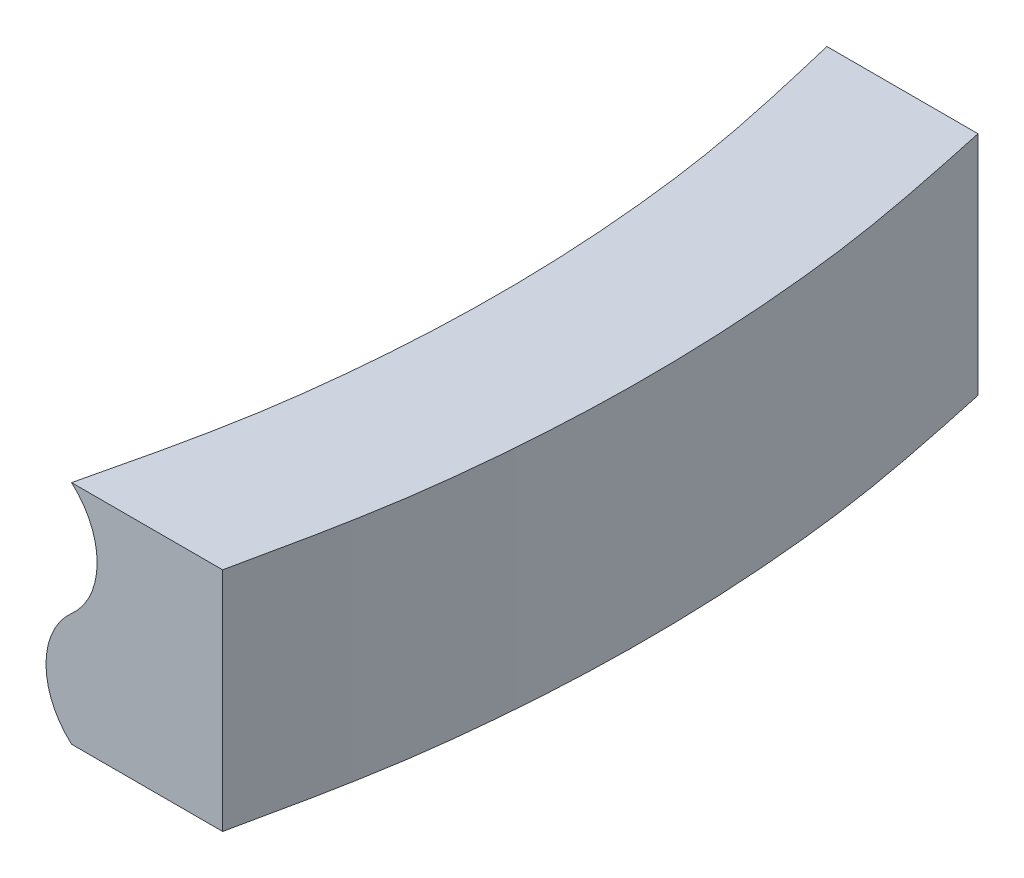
ISO-10303-21;
HEADER;
FILE_DESCRIPTION(('STEP AP214'),'2;1');
FILE_NAME('part.step','',(''),(''),'','','');
FILE_SCHEMA(('AUTOMOTIVE_DESIGN { 1 0 10303 214 1 1 1 1 }'));
ENDSEC;
DATA;
#1=APPLICATION_CONTEXT('core data for automotive mechanical design processes');
#2=APPLICATION_PROTOCOL_DEFINITION('international standard','automotive_design',2000,#1);
#3=PRODUCT_CONTEXT('',#1,'mechanical');
#4=PRODUCT('Part','Part','',(#3));
#5=PRODUCT_RELATED_PRODUCT_CATEGORY('part','',(#4));
#6=PRODUCT_DEFINITION_FORMATION('','',#4);
#7=PRODUCT_DEFINITION_CONTEXT('part definition',#1,'design');
#8=PRODUCT_DEFINITION('design','',#6,#7);
#9=PRODUCT_DEFINITION_SHAPE('','',#8);
#10=(LENGTH_UNIT() NAMED_UNIT(*) SI_UNIT(.MILLI.,.METRE.));
#11=(NAMED_UNIT(*) PLANE_ANGLE_UNIT() SI_UNIT($,.RADIAN.));
#12=(NAMED_UNIT(*) SI_UNIT($,.STERADIAN.) SOLID_ANGLE_UNIT());
#13=UNCERTAINTY_MEASURE_WITH_UNIT(LENGTH_MEASURE(1.E-05),#10,'distance_accuracy_value','');
#14=(GEOMETRIC_REPRESENTATION_CONTEXT(3) GLOBAL_UNCERTAINTY_ASSIGNED_CONTEXT((#13)) GLOBAL_UNIT_ASSIGNED_CONTEXT((#10,
#11,#12)) REPRESENTATION_CONTEXT('',''));
#15=CARTESIAN_POINT('',(0.,0.,0.));
#16=DIRECTION('',(0.,0.,1.));
#17=DIRECTION('',(1.,0.,0.));
#18=AXIS2_PLACEMENT_3D('',#15,#16,#17);
#19=CARTESIAN_POINT('',(-33.2287565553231,15.,0.));
#20=DIRECTION('',(0.,0.,1.));
#21=DIRECTION('',(1.,0.,0.));
#22=AXIS2_PLACEMENT_3D('',#19,#20,#21);
#23=PLANE('',#22);
#24=CARTESIAN_POINT('',(-33.2287565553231,15.,0.));
#25=DIRECTION('',(0.,0.,-1.));
#26=DIRECTION('',(1.,0.,0.));
#27=AXIS2_PLACEMENT_3D('',#24,#25,#26);
#28=CIRCLE('',#27,20.0000000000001);
#29=CARTESIAN_POINT('',(-20.,30.,0.));
#30=VERTEX_POINT('',#29);
#31=CARTESIAN_POINT('',(-20.0000000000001,0.,0.));
#32=VERTEX_POINT('',#31);
#33=EDGE_CURVE('E594',#30,#32,#28,.T.);
#34=ORIENTED_EDGE('',*,*,#33,.F.);
#35=DIRECTION('',(-1.,0.,0.));
#36=VECTOR('',#35,1.);
#37=CARTESIAN_POINT('',(20.,30.,0.));
#38=LINE('',#37,#36);
#39=CARTESIAN_POINT('',(20.,30.,0.));
#40=VERTEX_POINT('',#39);
#41=EDGE_CURVE('E596',#40,#30,#38,.T.);
#42=ORIENTED_EDGE('',*,*,#41,.F.);
#43=DIRECTION('',(0.,1.,0.));
#44=VECTOR('',#43,1.);
#45=CARTESIAN_POINT('',(20.,-30.,0.));
#46=LINE('',#45,#44);
#47=CARTESIAN_POINT('',(20.,-30.,0.));
#48=VERTEX_POINT('',#47);
#49=EDGE_CURVE('E592',#48,#40,#46,.T.);
#50=ORIENTED_EDGE('',*,*,#49,.F.);
#51=DIRECTION('',(1.,0.,0.));
#52=VECTOR('',#51,1.);
#53=CARTESIAN_POINT('',(20.,-30.,0.));
#54=LINE('',#53,#52);
#55=CARTESIAN_POINT('',(-20.,-30.,0.));
#56=VERTEX_POINT('',#55);
#57=EDGE_CURVE('E519',#56,#48,#54,.T.);
#58=ORIENTED_EDGE('',*,*,#57,.F.);
#59=CARTESIAN_POINT('',(-6.77124344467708,-15.,0.));
#60=DIRECTION('',(0.,0.,1.));
#61=DIRECTION('',(-1.,0.,0.));
#62=AXIS2_PLACEMENT_3D('',#59,#60,#61);
#63=CIRCLE('',#62,20.);
#64=EDGE_CURVE('E12',#32,#56,#63,.T.);
#65=ORIENTED_EDGE('',*,*,#64,.F.);
#66=EDGE_LOOP('',(#34,#42,#50,#58,#65));
#67=FACE_BOUND('',#66,.T.);
#68=ADVANCED_FACE('F509',(#67),#23,.F.);
#69=CARTESIAN_POINT('',(-33.228756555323,15.,200.));
#70=DIRECTION('',(0.,0.,1.));
#71=DIRECTION('',(1.,0.,0.));
#72=AXIS2_PLACEMENT_3D('',#69,#70,#71);
#73=PLANE('',#72);
#74=CARTESIAN_POINT('',(-33.228756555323,15.,200.));
#75=DIRECTION('',(0.,0.,-1.));
#76=DIRECTION('',(1.,0.,0.));
#77=AXIS2_PLACEMENT_3D('',#74,#75,#76);
#78=CIRCLE('',#77,20.);
#79=CARTESIAN_POINT('',(-20.,30.,200.));
#80=VERTEX_POINT('',#79);
#81=CARTESIAN_POINT('',(-20.,0.,200.));
#82=VERTEX_POINT('',#81);
#83=EDGE_CURVE('E586',#80,#82,#78,.T.);
#84=ORIENTED_EDGE('',*,*,#83,.T.);
#85=CARTESIAN_POINT('',(-6.77124344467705,-15.,200.));
#86=DIRECTION('',(0.,0.,1.));
#87=DIRECTION('',(-1.,0.,0.));
#88=AXIS2_PLACEMENT_3D('',#85,#86,#87);
#89=CIRCLE('',#88,20.);
#90=CARTESIAN_POINT('',(-20.,-30.,200.));
#91=VERTEX_POINT('',#90);
#92=EDGE_CURVE('E761',#82,#91,#89,.T.);
#93=ORIENTED_EDGE('',*,*,#92,.T.);
#94=DIRECTION('',(1.,0.,0.));
#95=VECTOR('',#94,1.);
#96=CARTESIAN_POINT('',(20.,-30.,200.));
#97=LINE('',#96,#95);
#98=CARTESIAN_POINT('',(20.,-30.,200.));
#99=VERTEX_POINT('',#98);
#100=EDGE_CURVE('E567',#91,#99,#97,.T.);
#101=ORIENTED_EDGE('',*,*,#100,.T.);
#102=DIRECTION('',(0.,1.,0.));
#103=VECTOR('',#102,1.);
#104=CARTESIAN_POINT('',(20.,-30.,200.));
#105=LINE('',#104,#103);
#106=CARTESIAN_POINT('',(20.,30.,200.));
#107=VERTEX_POINT('',#106);
#108=EDGE_CURVE('E559',#99,#107,#105,.T.);
#109=ORIENTED_EDGE('',*,*,#108,.T.);
#110=DIRECTION('',(-1.,0.,0.));
#111=VECTOR('',#110,1.);
#112=CARTESIAN_POINT('',(20.,30.,200.));
#113=LINE('',#112,#111);
#114=EDGE_CURVE('E564',#107,#80,#113,.T.);
#115=ORIENTED_EDGE('',*,*,#114,.T.);
#116=EDGE_LOOP('',(#84,#93,#101,#109,#115));
#117=FACE_BOUND('',#116,.T.);
#118=ADVANCED_FACE('F563',(#117),#73,.T.);
#119=CARTESIAN_POINT('',(20.,-30.,200.));
#120=DIRECTION('',(0.,-1.,0.));
#121=DIRECTION('',(-1.,0.,0.));
#122=AXIS2_PLACEMENT_3D('',#119,#120,#121);
#123=PLANE('',#122);
#124=ORIENTED_EDGE('',*,*,#100,.F.);
#125=CARTESIAN_POINT('',(-20.,-30.,200.));
#126=CARTESIAN_POINT('',(-16.5585497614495,-30.,185.554718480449));
#127=CARTESIAN_POINT('',(-12.1780591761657,-30.,167.167871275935));
#128=CARTESIAN_POINT('',(-8.32611579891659,-30.,137.735032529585));
#129=CARTESIAN_POINT('',(-6.59535172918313,-30.,114.842220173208));
#130=CARTESIAN_POINT('',(-6.59534850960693,-30.,85.1578720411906));
#131=CARTESIAN_POINT('',(-8.32605050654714,-30.,62.2651656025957));
#132=CARTESIAN_POINT('',(-12.1779761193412,-30.,32.8323454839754));
#133=CARTESIAN_POINT('',(-16.5585067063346,-30.,14.4454042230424));
#134=CARTESIAN_POINT('',(-20.,-30.,0.));
#135=B_SPLINE_CURVE_WITH_KNOTS('',3,(#125,#126,#127,#128,#129,#130,#131,#132,#133,#134),
.UNSPECIFIED.,.F.,.F.,(4,1,1,1,1,1,1,4),(0.,0.219963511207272,0.279983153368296,
0.43999217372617,0.560007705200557,0.720015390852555,0.780034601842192,1.),.UNSPECIFIED.);
#136=EDGE_CURVE('E534',#91,#56,#135,.T.);
#137=ORIENTED_EDGE('',*,*,#136,.T.);
#138=ORIENTED_EDGE('',*,*,#57,.T.);
#139=CARTESIAN_POINT('',(20.,-30.,200.));
#140=CARTESIAN_POINT('',(23.1151661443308,-30.,185.511956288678));
#141=CARTESIAN_POINT('',(27.0803421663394,-30.,167.070678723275));
#142=CARTESIAN_POINT('',(30.5631498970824,-30.,137.666206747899));
#143=CARTESIAN_POINT('',(32.1279583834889,-30.,114.817469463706));
#144=CARTESIAN_POINT('',(32.1279610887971,-30.,85.1826650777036));
#145=CARTESIAN_POINT('',(30.5632148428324,-30.,62.3340576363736));
#146=CARTESIAN_POINT('',(27.0804291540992,-30.,32.9295296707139));
#147=CARTESIAN_POINT('',(23.1152103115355,-30.,14.488162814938));
#148=CARTESIAN_POINT('',(20.,-30.,0.));
#149=B_SPLINE_CURVE_WITH_KNOTS('',3,(#139,#140,#141,#142,#143,#144,#145,#146,#147,#148),
.UNSPECIFIED.,.F.,.F.,(4,1,1,1,1,1,1,4),(0.,0.219963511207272,0.279983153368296,
0.43999217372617,0.560007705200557,0.720015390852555,0.780034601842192,1.),.UNSPECIFIED.);
#150=EDGE_CURVE('E613',#48,#99,#149,.F.);
#151=ORIENTED_EDGE('',*,*,#150,.T.);
#152=EDGE_LOOP('',(#124,#137,#138,#151));
#153=FACE_BOUND('',#152,.T.);
#154=ADVANCED_FACE('F653',(#153),#123,.T.);
#155=CARTESIAN_POINT('',(-20.,-30.,200.));
#156=CARTESIAN_POINT('',(-16.5585497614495,-30.,185.554718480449));
#157=CARTESIAN_POINT('',(-12.1780591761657,-30.,167.167871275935));
#158=CARTESIAN_POINT('',(-8.32611579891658,-30.,137.735032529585));
#159=CARTESIAN_POINT('',(-6.59535172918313,-30.,114.842220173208));
#160=CARTESIAN_POINT('',(-6.59534850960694,-30.,85.1578720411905));
#161=CARTESIAN_POINT('',(-8.32605050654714,-30.,62.2651656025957));
#162=CARTESIAN_POINT('',(-12.1779761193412,-30.,32.8323454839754));
#163=CARTESIAN_POINT('',(-16.5585067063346,-30.,14.4454042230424));
#164=CARTESIAN_POINT('',(-20.,-30.,0.));
#165=CARTESIAN_POINT('',(-21.0600775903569,-29.0650994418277,200.));
#166=CARTESIAN_POINT('',(-17.6130201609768,-29.0623754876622,185.555859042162));
#167=CARTESIAN_POINT('',(-13.2253923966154,-29.0589082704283,167.170463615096));
#168=CARTESIAN_POINT('',(-9.36703102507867,-29.0557820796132,137.736875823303));
#169=CARTESIAN_POINT('',(-7.63337194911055,-29.0543707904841,114.842883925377));
#170=CARTESIAN_POINT('',(-7.6333687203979,-29.0543707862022,85.1572071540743));
#171=CARTESIAN_POINT('',(-9.36696572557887,-29.0557820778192,62.2633205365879));
#172=CARTESIAN_POINT('',(-13.2253094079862,-29.0589083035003,32.8297533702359));
#173=CARTESIAN_POINT('',(-17.6129771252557,-29.0623754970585,14.444263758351));
#174=CARTESIAN_POINT('',(-21.0600775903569,-29.0650994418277,0.));
#175=CARTESIAN_POINT('',(-22.9813051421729,-26.9698133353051,200.));
#176=CARTESIAN_POINT('',(-19.5211231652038,-26.9618430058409,185.557919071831));
#177=CARTESIAN_POINT('',(-15.1167896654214,-26.9516978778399,167.175145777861));
#178=CARTESIAN_POINT('',(-11.2441810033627,-26.9430182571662,137.740199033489));
#179=CARTESIAN_POINT('',(-9.5040168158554,-26.9390611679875,114.844079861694));
#180=CARTESIAN_POINT('',(-9.50401356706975,-26.9390611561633,85.156009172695));
#181=CARTESIAN_POINT('',(-11.2441156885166,-26.9430182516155,62.2599941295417));
#182=CARTESIAN_POINT('',(-15.1167068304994,-26.9516979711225,32.8250716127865));
#183=CARTESIAN_POINT('',(-19.5210801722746,-26.9618430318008,14.4422039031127));
#184=CARTESIAN_POINT('',(-22.9813051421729,-26.9698133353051,0.));
#185=CARTESIAN_POINT('',(-25.1371152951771,-23.2906453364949,199.999999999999));
#186=CARTESIAN_POINT('',(-21.6590406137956,-23.28048493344,185.560222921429));
#187=CARTESIAN_POINT('',(-17.2319321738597,-23.2675521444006,167.180382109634));
#188=CARTESIAN_POINT('',(-13.3371211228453,-23.2555317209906,137.743902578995));
#189=CARTESIAN_POINT('',(-11.5871860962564,-23.2501997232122,114.845411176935));
#190=CARTESIAN_POINT('',(-11.5871828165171,-23.2501997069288,85.1546755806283));
#191=CARTESIAN_POINT('',(-13.3370557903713,-23.2555317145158,62.2562870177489));
#192=CARTESIAN_POINT('',(-17.2318495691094,-23.2675522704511,32.8198357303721));
#193=CARTESIAN_POINT('',(-21.658997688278,-23.2804849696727,14.4399002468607));
#194=CARTESIAN_POINT('',(-25.1371152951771,-23.2906453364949,0.));
#195=CARTESIAN_POINT('',(-26.470511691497,-19.2402865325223,200.000000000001));
#196=CARTESIAN_POINT('',(-22.9762727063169,-19.2329440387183,185.561635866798));
#197=CARTESIAN_POINT('',(-18.5285893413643,-19.223598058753,167.183593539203));
#198=CARTESIAN_POINT('',(-14.6184866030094,-19.2158622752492,137.74616901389));
#199=CARTESIAN_POINT('',(-12.8613925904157,-19.2123403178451,114.846225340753));
#200=CARTESIAN_POINT('',(-12.8613892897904,-19.2123403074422,85.153860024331));
#201=CARTESIAN_POINT('',(-14.6184212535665,-19.2158622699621,62.254018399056));
#202=CARTESIAN_POINT('',(-18.5285069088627,-19.2235981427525,32.8166245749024));
#203=CARTESIAN_POINT('',(-22.9762298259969,-19.2329440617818,14.4384874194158));
#204=CARTESIAN_POINT('',(-26.470511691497,-19.2402865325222,0.));
#205=CARTESIAN_POINT('',(-26.9216918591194,-15.,199.999999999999));
#206=CARTESIAN_POINT('',(-23.4244269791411,-15.,185.562119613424));
#207=CARTESIAN_POINT('',(-18.9728920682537,-15.0000000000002,167.184693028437));
#208=CARTESIAN_POINT('',(-15.0560436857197,-14.9999999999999,137.746942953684));
#209=CARTESIAN_POINT('',(-13.2962964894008,-15.,114.846503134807));
#210=CARTESIAN_POINT('',(-13.2962931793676,-15.0000000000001,85.1535817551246));
#211=CARTESIAN_POINT('',(-15.0559783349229,-14.9999999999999,62.2532437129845));
#212=CARTESIAN_POINT('',(-18.9728096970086,-15.0000000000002,32.8155251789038));
#213=CARTESIAN_POINT('',(-23.4243841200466,-15.0000000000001,14.4380037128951));
#214=CARTESIAN_POINT('',(-26.9216918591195,-15.,0.));
#215=CARTESIAN_POINT('',(-26.470511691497,-10.7597134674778,200.000000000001));
#216=CARTESIAN_POINT('',(-22.976272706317,-10.7670559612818,185.561635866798));
#217=CARTESIAN_POINT('',(-18.5285893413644,-10.776401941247,167.183593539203));
#218=CARTESIAN_POINT('',(-14.6184866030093,-10.7841377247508,137.746169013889));
#219=CARTESIAN_POINT('',(-12.8613925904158,-10.7876596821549,114.846225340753));
#220=CARTESIAN_POINT('',(-12.8613892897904,-10.7876596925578,85.153860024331));
#221=CARTESIAN_POINT('',(-14.6184212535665,-10.784137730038,62.254018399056));
#222=CARTESIAN_POINT('',(-18.5285069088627,-10.7764018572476,32.8166245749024));
#223=CARTESIAN_POINT('',(-22.976229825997,-10.7670559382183,14.4384874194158));
#224=CARTESIAN_POINT('',(-26.4705116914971,-10.7597134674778,0.));
#225=CARTESIAN_POINT('',(-25.1371152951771,-6.70935466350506,200.));
#226=CARTESIAN_POINT('',(-21.6590406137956,-6.71951506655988,185.56022292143));
#227=CARTESIAN_POINT('',(-17.2319321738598,-6.73244785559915,167.180382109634));
#228=CARTESIAN_POINT('',(-13.3371211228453,-6.74446827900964,137.743902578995));
#229=CARTESIAN_POINT('',(-11.5871860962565,-6.74980027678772,114.845411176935));
#230=CARTESIAN_POINT('',(-11.5871828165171,-6.74980029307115,85.1546755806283));
#231=CARTESIAN_POINT('',(-13.3370557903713,-6.74446828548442,62.2562870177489));
#232=CARTESIAN_POINT('',(-17.2318495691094,-6.73244772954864,32.819835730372));
#233=CARTESIAN_POINT('',(-21.658997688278,-6.71951503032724,14.4399002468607));
#234=CARTESIAN_POINT('',(-25.1371152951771,-6.7093546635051,0.));
#235=CARTESIAN_POINT('',(-22.9813051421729,-3.03018666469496,200.));
#236=CARTESIAN_POINT('',(-19.5211231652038,-3.03815699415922,185.557919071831));
#237=CARTESIAN_POINT('',(-15.1167896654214,-3.04830212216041,167.175145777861));
#238=CARTESIAN_POINT('',(-11.2441810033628,-3.05698174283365,137.740199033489));
#239=CARTESIAN_POINT('',(-9.50401681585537,-3.06093883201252,114.844079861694));
#240=CARTESIAN_POINT('',(-9.50401356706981,-3.06093884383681,85.1560091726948));
#241=CARTESIAN_POINT('',(-11.2441156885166,-3.0569817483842,62.2599941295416));
#242=CARTESIAN_POINT('',(-15.1167068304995,-3.04830202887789,32.8250716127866));
#243=CARTESIAN_POINT('',(-19.5210801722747,-3.03815696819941,14.4422039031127));
#244=CARTESIAN_POINT('',(-22.981305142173,-3.03018666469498,0.));
#245=CARTESIAN_POINT('',(-21.0600775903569,-0.934900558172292,200.));
#246=CARTESIAN_POINT('',(-17.6130201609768,-0.937624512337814,185.555859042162));
#247=CARTESIAN_POINT('',(-13.2253923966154,-0.941091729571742,167.170463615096));
#248=CARTESIAN_POINT('',(-9.36703102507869,-0.944217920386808,137.736875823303));
#249=CARTESIAN_POINT('',(-7.6333719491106,-0.945629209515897,114.842883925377));
#250=CARTESIAN_POINT('',(-7.63336872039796,-0.945629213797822,85.1572071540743));
#251=CARTESIAN_POINT('',(-9.36696572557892,-0.944217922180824,62.2633205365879));
#252=CARTESIAN_POINT('',(-13.2253094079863,-0.94109169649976,32.8297533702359));
#253=CARTESIAN_POINT('',(-17.6129771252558,-0.937624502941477,14.444263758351));
#254=CARTESIAN_POINT('',(-21.060077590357,-0.934900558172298,0.));
#255=CARTESIAN_POINT('',(-18.9399224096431,0.93490055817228,200.));
#256=CARTESIAN_POINT('',(-15.5040793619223,0.937624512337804,185.553577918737));
#257=CARTESIAN_POINT('',(-11.130725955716,0.941091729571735,167.165278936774));
#258=CARTESIAN_POINT('',(-7.28520057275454,0.944217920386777,137.733189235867));
#259=CARTESIAN_POINT('',(-5.55733150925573,0.945629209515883,114.841556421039));
#260=CARTESIAN_POINT('',(-5.55732829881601,0.945629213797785,85.1585369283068));
#261=CARTESIAN_POINT('',(-7.28513528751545,0.944217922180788,62.2670106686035));
#262=CARTESIAN_POINT('',(-11.1306428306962,0.941091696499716,32.8349375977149));
#263=CARTESIAN_POINT('',(-15.5040362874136,0.937624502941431,14.4465446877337));
#264=CARTESIAN_POINT('',(-18.9399224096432,0.93490055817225,0.));
#265=CARTESIAN_POINT('',(-17.0186948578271,3.03018666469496,200.));
#266=CARTESIAN_POINT('',(-13.5959763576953,3.03815699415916,185.551517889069));
#267=CARTESIAN_POINT('',(-9.23932868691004,3.04830212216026,167.160596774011));
#268=CARTESIAN_POINT('',(-5.40805059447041,3.0569817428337,137.729866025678));
#269=CARTESIAN_POINT('',(-3.68668664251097,3.06093883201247,114.840360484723));
#270=CARTESIAN_POINT('',(-3.68668345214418,3.06093884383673,85.1597349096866));
#271=CARTESIAN_POINT('',(-5.4079853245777,3.05698174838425,62.2703370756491));
#272=CARTESIAN_POINT('',(-9.23924540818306,3.04830202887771,32.8396193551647));
#273=CARTESIAN_POINT('',(-13.5959332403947,3.03815696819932,14.4486045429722));
#274=CARTESIAN_POINT('',(-17.0186948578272,3.03018666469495,0.));
#275=CARTESIAN_POINT('',(-14.8628847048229,6.70935466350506,200.));
#276=CARTESIAN_POINT('',(-11.4580589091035,6.71951506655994,185.549214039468));
#277=CARTESIAN_POINT('',(-7.12418617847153,6.7324478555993,167.155360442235));
#278=CARTESIAN_POINT('',(-3.31511047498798,6.74446827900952,137.726162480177));
#279=CARTESIAN_POINT('',(-1.6035173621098,6.74980027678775,114.839029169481));
#280=CARTESIAN_POINT('',(-1.60351420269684,6.74980029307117,85.1610685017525));
#281=CARTESIAN_POINT('',(-3.3150452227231,6.74446828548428,62.274044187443));
#282=CARTESIAN_POINT('',(-7.12410266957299,6.73244772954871,32.8448552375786));
#283=CARTESIAN_POINT('',(-11.4580157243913,6.71951503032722,14.4509081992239));
#284=CARTESIAN_POINT('',(-14.862884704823,6.70935466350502,0.));
#285=CARTESIAN_POINT('',(-13.529488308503,10.7597134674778,200.));
#286=CARTESIAN_POINT('',(-10.1408268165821,10.7670559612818,185.5478010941));
#287=CARTESIAN_POINT('',(-5.82752901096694,10.776401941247,167.152149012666));
#288=CARTESIAN_POINT('',(-2.03374499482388,10.7841377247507,137.723896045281));
#289=CARTESIAN_POINT('',(-0.32931086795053,10.7876596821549,114.838215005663));
#290=CARTESIAN_POINT('',(-0.329307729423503,10.7876596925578,85.1618840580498));
#291=CARTESIAN_POINT('',(-2.03367975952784,10.7841377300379,62.2763128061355));
#292=CARTESIAN_POINT('',(-5.82744532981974,10.7764018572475,32.8480663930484));
#293=CARTESIAN_POINT('',(-10.1407835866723,10.7670559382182,14.4523210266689));
#294=CARTESIAN_POINT('',(-13.5294883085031,10.7597134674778,0.));
#295=CARTESIAN_POINT('',(-13.0783081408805,15.,200.));
#296=CARTESIAN_POINT('',(-9.692672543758,15.,185.547317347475));
#297=CARTESIAN_POINT('',(-5.38322628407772,15.,167.151049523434));
#298=CARTESIAN_POINT('',(-1.59618791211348,15.,137.723122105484));
#299=CARTESIAN_POINT('',(0.105593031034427,15.,114.83793721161));
#300=CARTESIAN_POINT('',(0.105596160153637,15.,85.1621623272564));
#301=CARTESIAN_POINT('',(-1.5961226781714,14.9999999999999,62.2770874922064));
#302=CARTESIAN_POINT('',(-5.38314254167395,15.,32.8491657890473));
#303=CARTESIAN_POINT('',(-9.69262929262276,14.9999999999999,14.4528047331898));
#304=CARTESIAN_POINT('',(-13.0783081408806,14.9999999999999,0.));
#305=CARTESIAN_POINT('',(-13.529488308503,19.2402865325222,200.));
#306=CARTESIAN_POINT('',(-10.1408268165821,19.2329440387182,185.547801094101));
#307=CARTESIAN_POINT('',(-5.82752901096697,19.223598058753,167.152149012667));
#308=CARTESIAN_POINT('',(-2.03374499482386,19.2158622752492,137.72389604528));
#309=CARTESIAN_POINT('',(-0.329310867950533,19.2123403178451,114.838215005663));
#310=CARTESIAN_POINT('',(-0.329307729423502,19.2123403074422,85.1618840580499));
#311=CARTESIAN_POINT('',(-2.03367975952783,19.215862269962,62.2763128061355));
#312=CARTESIAN_POINT('',(-5.82744532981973,19.2235981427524,32.8480663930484));
#313=CARTESIAN_POINT('',(-10.1407835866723,19.2329440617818,14.452321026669));
#314=CARTESIAN_POINT('',(-13.5294883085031,19.2402865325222,0.));
#315=CARTESIAN_POINT('',(-14.8628847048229,23.2906453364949,200.));
#316=CARTESIAN_POINT('',(-11.4580589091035,23.28048493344,185.549214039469));
#317=CARTESIAN_POINT('',(-7.12418617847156,23.2675521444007,167.155360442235));
#318=CARTESIAN_POINT('',(-3.31511047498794,23.2555317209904,137.726162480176));
#319=CARTESIAN_POINT('',(-1.60351736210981,23.2501997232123,114.839029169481));
#320=CARTESIAN_POINT('',(-1.60351420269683,23.2501997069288,85.1610685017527));
#321=CARTESIAN_POINT('',(-3.31504522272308,23.2555317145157,62.274044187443));
#322=CARTESIAN_POINT('',(-7.12410266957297,23.2675522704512,32.8448552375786));
#323=CARTESIAN_POINT('',(-11.4580157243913,23.2804849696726,14.4509081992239));
#324=CARTESIAN_POINT('',(-14.862884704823,23.2906453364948,0.));
#325=CARTESIAN_POINT('',(-17.0186948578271,26.969813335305,200.));
#326=CARTESIAN_POINT('',(-13.5959763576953,26.9618430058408,185.551517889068));
#327=CARTESIAN_POINT('',(-9.23932868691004,26.9516978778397,167.16059677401));
#328=CARTESIAN_POINT('',(-5.40805059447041,26.9430182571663,137.729866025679));
#329=CARTESIAN_POINT('',(-3.68668664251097,26.9390611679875,114.840360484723));
#330=CARTESIAN_POINT('',(-3.68668345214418,26.9390611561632,85.1597349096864));
#331=CARTESIAN_POINT('',(-5.4079853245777,26.9430182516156,62.2703370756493));
#332=CARTESIAN_POINT('',(-9.23924540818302,26.9516979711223,32.8396193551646));
#333=CARTESIAN_POINT('',(-13.5959332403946,26.9618430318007,14.4486045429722));
#334=CARTESIAN_POINT('',(-17.0186948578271,26.969813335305,0.));
#335=CARTESIAN_POINT('',(-18.9399224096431,29.0650994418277,200.));
#336=CARTESIAN_POINT('',(-15.5040793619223,29.0623754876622,185.553577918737));
#337=CARTESIAN_POINT('',(-11.130725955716,29.0589082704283,167.165278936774));
#338=CARTESIAN_POINT('',(-7.2852005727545,29.0557820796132,137.733189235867));
#339=CARTESIAN_POINT('',(-5.55733150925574,29.0543707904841,114.841556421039));
#340=CARTESIAN_POINT('',(-5.557328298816,29.0543707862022,85.1585369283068));
#341=CARTESIAN_POINT('',(-7.28513528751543,29.0557820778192,62.2670106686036));
#342=CARTESIAN_POINT('',(-11.1306428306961,29.0589083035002,32.8349375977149));
#343=CARTESIAN_POINT('',(-15.5040362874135,29.0623754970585,14.4465446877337));
#344=CARTESIAN_POINT('',(-18.9399224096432,29.0650994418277,0.));
#345=CARTESIAN_POINT('',(-20.,30.,200.));
#346=CARTESIAN_POINT('',(-16.5585497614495,30.,185.554718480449));
#347=CARTESIAN_POINT('',(-12.1780591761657,30.,167.167871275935));
#348=CARTESIAN_POINT('',(-8.32611579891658,30.,137.735032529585));
#349=CARTESIAN_POINT('',(-6.59535172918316,30.,114.842220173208));
#350=CARTESIAN_POINT('',(-6.59534850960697,30.,85.1578720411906));
#351=CARTESIAN_POINT('',(-8.32605050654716,30.,62.2651656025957));
#352=CARTESIAN_POINT('',(-12.1779761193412,30.,32.8323454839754));
#353=CARTESIAN_POINT('',(-16.5585067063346,30.,14.4454042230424));
#354=CARTESIAN_POINT('',(-20.,30.,0.));
#355=B_SPLINE_SURFACE_WITH_KNOTS('',3,3,((#155,#156,#157,#158,#159,#160,#161,#162,#163,#164),
(#165,#166,#167,#168,#169,#170,#171,#172,#173,#174),(#175,#176,#177,#178,#179,#180,#181,#182,
#183,#184),(#185,#186,#187,#188,#189,#190,#191,#192,#193,#194),(#195,#196,#197,#198,#199,#200,
#201,#202,#203,#204),(#205,#206,#207,#208,#209,#210,#211,#212,#213,#214),(#215,#216,#217,#218,
#219,#220,#221,#222,#223,#224),(#225,#226,#227,#228,#229,#230,#231,#232,#233,#234),(#235,#236,
#237,#238,#239,#240,#241,#242,#243,#244),(#245,#246,#247,#248,#249,#250,#251,#252,#253,#254),
(#255,#256,#257,#258,#259,#260,#261,#262,#263,#264),(#265,#266,#267,#268,#269,#270,#271,#272,
#273,#274),(#275,#276,#277,#278,#279,#280,#281,#282,#283,#284),(#285,#286,#287,#288,#289,#290,
#291,#292,#293,#294),(#295,#296,#297,#298,#299,#300,#301,#302,#303,#304),(#305,#306,#307,#308,
#309,#310,#311,#312,#313,#314),(#315,#316,#317,#318,#319,#320,#321,#322,#323,#324),(#325,#326,
#327,#328,#329,#330,#331,#332,#333,#334),(#335,#336,#337,#338,#339,#340,#341,#342,#343,#344),
(#345,#346,#347,#348,#349,#350,#351,#352,#353,#354)),.UNSPECIFIED.,.F.,.F.,.F.,(4,1,1,1,1,1,1,1,
2,1,1,1,1,1,1,1,4),(4,1,1,1,1,1,1,4),(0.,0.0625,0.125,0.1875,0.25,0.3125,0.375,0.4375,0.5,
0.5625,0.625,0.6875,0.75,0.8125,0.875,0.9375,1.),(0.,0.219963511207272,0.279983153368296,
0.43999217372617,0.560007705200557,0.720015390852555,0.780034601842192,1.),.UNSPECIFIED.);
#356=CARTESIAN_POINT('',(-20.,30.,200.));
#357=CARTESIAN_POINT('',(-16.5585497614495,30.,185.554718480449));
#358=CARTESIAN_POINT('',(-12.1780591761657,30.,167.167871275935));
#359=CARTESIAN_POINT('',(-8.32611579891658,30.,137.735032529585));
#360=CARTESIAN_POINT('',(-6.59535172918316,30.,114.842220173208));
#361=CARTESIAN_POINT('',(-6.59534850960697,30.,85.1578720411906));
#362=CARTESIAN_POINT('',(-8.32605050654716,30.,62.2651656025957));
#363=CARTESIAN_POINT('',(-12.1779761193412,30.,32.8323454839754));
#364=CARTESIAN_POINT('',(-16.5585067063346,30.,14.4454042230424));
#365=CARTESIAN_POINT('',(-20.,30.,0.));
#366=B_SPLINE_CURVE_WITH_KNOTS('',3,(#356,#357,#358,#359,#360,#361,#362,#363,#364,#365),
.UNSPECIFIED.,.F.,.F.,(4,1,1,1,1,1,1,4),(0.,0.219963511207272,0.279983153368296,
0.43999217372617,0.560007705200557,0.720015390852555,0.780034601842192,1.),.UNSPECIFIED.);
#367=EDGE_CURVE('E585',#80,#30,#366,.T.);
#368=ORIENTED_EDGE('',*,*,#92,.F.);
#369=ORIENTED_EDGE('',*,*,#83,.F.);
#370=ORIENTED_EDGE('',*,*,#367,.T.);
#371=ORIENTED_EDGE('',*,*,#33,.T.);
#372=ORIENTED_EDGE('',*,*,#64,.T.);
#373=ORIENTED_EDGE('',*,*,#136,.F.);
#374=EDGE_LOOP('',(#368,#369,#370,#371,#372,#373));
#375=FACE_BOUND('',#374,.T.);
#376=ADVANCED_FACE('F625',(#375),#355,.T.);
#377=CARTESIAN_POINT('',(20.,30.,200.));
#378=CARTESIAN_POINT('',(23.1151661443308,30.,185.511956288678));
#379=CARTESIAN_POINT('',(27.0803421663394,30.,167.070678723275));
#380=CARTESIAN_POINT('',(30.5631498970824,30.,137.666206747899));
#381=CARTESIAN_POINT('',(32.1279583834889,30.,114.817469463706));
#382=CARTESIAN_POINT('',(32.1279610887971,30.,85.1826650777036));
#383=CARTESIAN_POINT('',(30.5632148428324,30.,62.3340576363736));
#384=CARTESIAN_POINT('',(27.0804291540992,30.,32.9295296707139));
#385=CARTESIAN_POINT('',(23.1152103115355,30.,14.488162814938));
#386=CARTESIAN_POINT('',(20.,30.,0.));
#387=CARTESIAN_POINT('',(20.,-30.,200.));
#388=CARTESIAN_POINT('',(23.1151661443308,-30.,185.511956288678));
#389=CARTESIAN_POINT('',(27.0803421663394,-30.,167.070678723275));
#390=CARTESIAN_POINT('',(30.5631498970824,-30.,137.666206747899));
#391=CARTESIAN_POINT('',(32.1279583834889,-30.,114.817469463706));
#392=CARTESIAN_POINT('',(32.1279610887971,-30.,85.1826650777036));
#393=CARTESIAN_POINT('',(30.5632148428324,-30.,62.3340576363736));
#394=CARTESIAN_POINT('',(27.0804291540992,-30.,32.9295296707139));
#395=CARTESIAN_POINT('',(23.1152103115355,-30.,14.488162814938));
#396=CARTESIAN_POINT('',(20.,-30.,0.));
#397=B_SPLINE_SURFACE_WITH_KNOTS('',1,3,((#377,#378,#379,#380,#381,#382,#383,#384,#385,#386),
(#387,#388,#389,#390,#391,#392,#393,#394,#395,#396)),.UNSPECIFIED.,.F.,.F.,.F.,(2,2),(4,1,1,1,1,
1,1,4),(0.,1.),(0.,0.219963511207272,0.279983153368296,0.43999217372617,0.560007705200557,
0.720015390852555,0.780034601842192,1.),.UNSPECIFIED.);
#398=CARTESIAN_POINT('',(20.,30.,200.));
#399=CARTESIAN_POINT('',(23.1151661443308,30.,185.511956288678));
#400=CARTESIAN_POINT('',(27.0803421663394,30.,167.070678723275));
#401=CARTESIAN_POINT('',(30.5631498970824,30.,137.666206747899));
#402=CARTESIAN_POINT('',(32.1279583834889,30.,114.817469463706));
#403=CARTESIAN_POINT('',(32.1279610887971,30.,85.1826650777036));
#404=CARTESIAN_POINT('',(30.5632148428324,30.,62.3340576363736));
#405=CARTESIAN_POINT('',(27.0804291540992,30.,32.9295296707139));
#406=CARTESIAN_POINT('',(23.1152103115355,30.,14.488162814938));
#407=CARTESIAN_POINT('',(20.,30.,0.));
#408=B_SPLINE_CURVE_WITH_KNOTS('',3,(#398,#399,#400,#401,#402,#403,#404,#405,#406,#407),
.UNSPECIFIED.,.F.,.F.,(4,1,1,1,1,1,1,4),(0.,0.219963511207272,0.279983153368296,
0.43999217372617,0.560007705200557,0.720015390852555,0.780034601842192,1.),.UNSPECIFIED.);
#409=EDGE_CURVE('E582',#107,#40,#408,.T.);
#410=ORIENTED_EDGE('',*,*,#108,.F.);
#411=ORIENTED_EDGE('',*,*,#150,.F.);
#412=ORIENTED_EDGE('',*,*,#49,.T.);
#413=ORIENTED_EDGE('',*,*,#409,.F.);
#414=EDGE_LOOP('',(#410,#411,#412,#413));
#415=FACE_BOUND('',#414,.T.);
#416=ADVANCED_FACE('F590',(#415),#397,.T.);
#417=CARTESIAN_POINT('',(-20.,30.,200.));
#418=DIRECTION('',(0.,1.,0.));
#419=DIRECTION('',(1.,0.,0.));
#420=AXIS2_PLACEMENT_3D('',#417,#418,#419);
#421=PLANE('',#420);
#422=ORIENTED_EDGE('',*,*,#114,.F.);
#423=ORIENTED_EDGE('',*,*,#409,.T.);
#424=ORIENTED_EDGE('',*,*,#41,.T.);
#425=ORIENTED_EDGE('',*,*,#367,.F.);
#426=EDGE_LOOP('',(#422,#423,#424,#425));
#427=FACE_BOUND('',#426,.T.);
#428=ADVANCED_FACE('F581',(#427),#421,.T.);
#429=CLOSED_SHELL('',(#68,#118,#154,#376,#416,#428));
#430=MANIFOLD_SOLID_BREP('B2',#429);
#431=ADVANCED_BREP_SHAPE_REPRESENTATION('',(#18,#430),#14);
#432=SHAPE_DEFINITION_REPRESENTATION(#9,#431);
ENDSEC;
END-ISO-10303-21;
